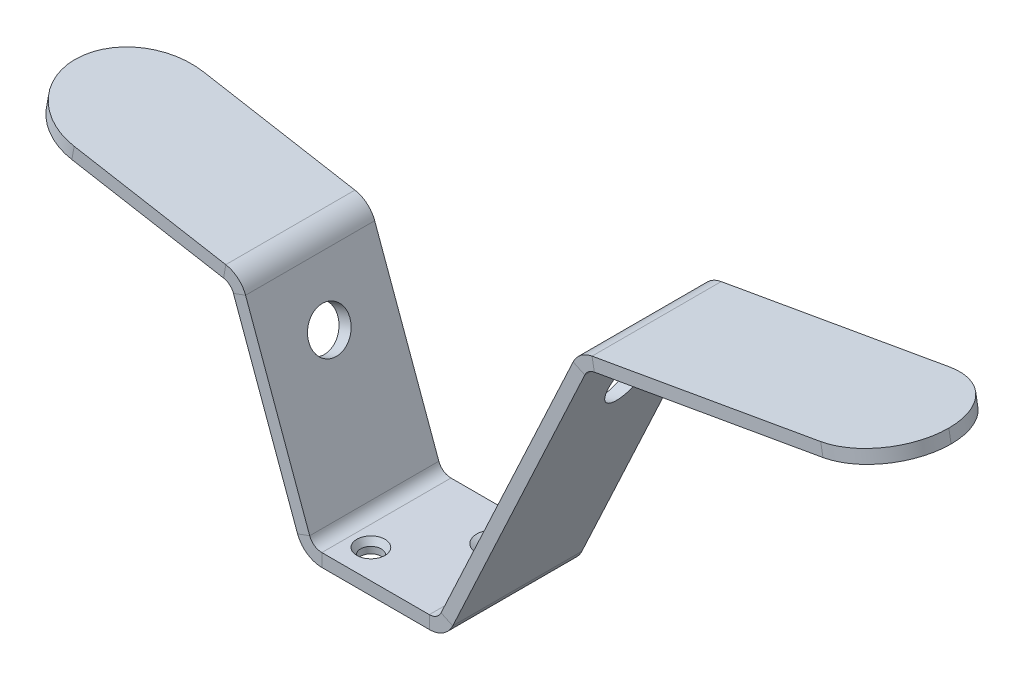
ISO-10303-21;
HEADER;
FILE_DESCRIPTION(('STEP AP214'),'2;1');
FILE_NAME('part.step','',(''),(''),'','','');
FILE_SCHEMA(('AUTOMOTIVE_DESIGN { 1 0 10303 214 1 1 1 1 }'));
ENDSEC;
DATA;
#1=APPLICATION_CONTEXT('core data for automotive mechanical design processes');
#2=APPLICATION_PROTOCOL_DEFINITION('international standard','automotive_design',2000,#1);
#3=PRODUCT_CONTEXT('',#1,'mechanical');
#4=PRODUCT('Part','Part','',(#3));
#5=PRODUCT_RELATED_PRODUCT_CATEGORY('part','',(#4));
#6=PRODUCT_DEFINITION_FORMATION('','',#4);
#7=PRODUCT_DEFINITION_CONTEXT('part definition',#1,'design');
#8=PRODUCT_DEFINITION('design','',#6,#7);
#9=PRODUCT_DEFINITION_SHAPE('','',#8);
#10=(LENGTH_UNIT() NAMED_UNIT(*) SI_UNIT(.MILLI.,.METRE.));
#11=(NAMED_UNIT(*) PLANE_ANGLE_UNIT() SI_UNIT($,.RADIAN.));
#12=(NAMED_UNIT(*) SI_UNIT($,.STERADIAN.) SOLID_ANGLE_UNIT());
#13=UNCERTAINTY_MEASURE_WITH_UNIT(LENGTH_MEASURE(1.E-05),#10,'distance_accuracy_value','');
#14=(GEOMETRIC_REPRESENTATION_CONTEXT(3) GLOBAL_UNCERTAINTY_ASSIGNED_CONTEXT((#13)) GLOBAL_UNIT_ASSIGNED_CONTEXT((#10,
#11,#12)) REPRESENTATION_CONTEXT('',''));
#15=CARTESIAN_POINT('',(0.,0.,0.));
#16=DIRECTION('',(0.,0.,1.));
#17=DIRECTION('',(1.,0.,0.));
#18=AXIS2_PLACEMENT_3D('',#15,#16,#17);
#19=CARTESIAN_POINT('',(-71.2127899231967,-40.1106257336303,10.));
#20=DIRECTION('',(0.173648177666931,0.984807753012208,0.));
#21=DIRECTION('',(-0.984807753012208,0.173648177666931,0.));
#22=AXIS2_PLACEMENT_3D('',#19,#20,#21);
#23=CYLINDRICAL_SURFACE('',#22,10.);
#24=DIRECTION('',(0.173648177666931,0.984807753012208,0.));
#25=VECTOR('',#24,1.);
#26=CARTESIAN_POINT('',(-81.0608674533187,-38.374143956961,10.));
#27=LINE('',#26,#25);
#28=CARTESIAN_POINT('',(-67.7549360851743,37.0875427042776,10.));
#29=VERTEX_POINT('',#28);
#30=CARTESIAN_POINT('',(-67.4076397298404,39.057158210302,10.));
#31=VERTEX_POINT('',#30);
#32=EDGE_CURVE('E266',#29,#31,#27,.T.);
#33=ORIENTED_EDGE('',*,*,#32,.T.);
#34=CARTESIAN_POINT('',(-57.5595621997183,37.3206764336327,10.));
#35=DIRECTION('',(-0.173648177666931,-0.984807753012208,0.));
#36=DIRECTION('',(0.984807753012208,-0.173648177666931,0.));
#37=AXIS2_PLACEMENT_3D('',#34,#35,#36);
#38=CIRCLE('',#37,10.);
#39=CARTESIAN_POINT('',(-57.5595621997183,37.3206764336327,0.));
#40=VERTEX_POINT('',#39);
#41=EDGE_CURVE('E436',#40,#31,#38,.F.);
#42=ORIENTED_EDGE('',*,*,#41,.F.);
#43=DIRECTION('',(0.173648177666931,0.984807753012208,0.));
#44=VECTOR('',#43,1.);
#45=CARTESIAN_POINT('',(-71.2127899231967,-40.1106257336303,0.));
#46=LINE('',#45,#44);
#47=CARTESIAN_POINT('',(-57.9068585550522,35.3510609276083,0.));
#48=VERTEX_POINT('',#47);
#49=EDGE_CURVE('E260',#48,#40,#46,.T.);
#50=ORIENTED_EDGE('',*,*,#49,.F.);
#51=CARTESIAN_POINT('',(-57.9068585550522,35.3510609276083,10.));
#52=DIRECTION('',(-0.173648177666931,-0.984807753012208,0.));
#53=DIRECTION('',(0.984807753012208,-0.173648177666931,0.));
#54=AXIS2_PLACEMENT_3D('',#51,#52,#53);
#55=CIRCLE('',#54,10.);
#56=EDGE_CURVE('E44',#29,#48,#55,.T.);
#57=ORIENTED_EDGE('',*,*,#56,.F.);
#58=EDGE_LOOP('',(#33,#42,#50,#57));
#59=FACE_BOUND('',#58,.T.);
#60=ADVANCED_FACE('F27',(#59),#23,.T.);
#61=CARTESIAN_POINT('',(-71.2127899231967,-40.1106257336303,10.));
#62=DIRECTION('',(0.173648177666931,0.984807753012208,0.));
#63=DIRECTION('',(-0.984807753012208,0.173648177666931,0.));
#64=AXIS2_PLACEMENT_3D('',#61,#62,#63);
#65=CYLINDRICAL_SURFACE('',#64,10.);
#66=DIRECTION('',(0.173648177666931,0.984807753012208,0.));
#67=VECTOR('',#66,1.);
#68=CARTESIAN_POINT('',(-71.2127899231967,-40.1106257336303,20.));
#69=LINE('',#68,#67);
#70=CARTESIAN_POINT('',(-57.9068585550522,35.3510609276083,20.));
#71=VERTEX_POINT('',#70);
#72=CARTESIAN_POINT('',(-57.5595621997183,37.3206764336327,20.));
#73=VERTEX_POINT('',#72);
#74=EDGE_CURVE('E268',#71,#73,#69,.T.);
#75=ORIENTED_EDGE('',*,*,#74,.T.);
#76=CARTESIAN_POINT('',(-57.5595621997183,37.3206764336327,10.));
#77=DIRECTION('',(-0.173648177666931,-0.984807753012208,0.));
#78=DIRECTION('',(0.984807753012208,-0.173648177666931,0.));
#79=AXIS2_PLACEMENT_3D('',#76,#77,#78);
#80=CIRCLE('',#79,10.);
#81=EDGE_CURVE('E72',#31,#73,#80,.F.);
#82=ORIENTED_EDGE('',*,*,#81,.F.);
#83=ORIENTED_EDGE('',*,*,#32,.F.);
#84=CARTESIAN_POINT('',(-57.9068585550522,35.3510609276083,10.));
#85=DIRECTION('',(-0.173648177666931,-0.984807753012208,0.));
#86=DIRECTION('',(0.984807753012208,-0.173648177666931,0.));
#87=AXIS2_PLACEMENT_3D('',#84,#85,#86);
#88=CIRCLE('',#87,10.);
#89=EDGE_CURVE('E430',#71,#29,#88,.T.);
#90=ORIENTED_EDGE('',*,*,#89,.F.);
#91=EDGE_LOOP('',(#75,#82,#83,#90));
#92=FACE_BOUND('',#91,.T.);
#93=ADVANCED_FACE('F445',(#92),#65,.T.);
#94=CARTESIAN_POINT('',(-46.5925960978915,-44.4518301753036,20.));
#95=DIRECTION('',(0.,0.,-1.));
#96=DIRECTION('',(-0.984807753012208,0.173648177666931,0.));
#97=AXIS2_PLACEMENT_3D('',#94,#95,#96);
#98=PLANE('',#97);
#99=DIRECTION('',(0.173648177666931,0.984807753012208,0.));
#100=VECTOR('',#99,1.);
#101=CARTESIAN_POINT('',(-47.7297541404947,-44.251318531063,20.));
#102=LINE('',#101,#100);
#103=CARTESIAN_POINT('',(-34.4238227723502,31.2103681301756,20.));
#104=VERTEX_POINT('',#103);
#105=CARTESIAN_POINT('',(-34.0765264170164,33.1799836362,20.));
#106=VERTEX_POINT('',#105);
#107=EDGE_CURVE('E443',#104,#106,#102,.T.);
#108=ORIENTED_EDGE('',*,*,#107,.T.);
#109=DIRECTION('',(-0.984807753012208,0.173648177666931,0.));
#110=VECTOR('',#109,1.);
#111=CARTESIAN_POINT('',(-32.9393683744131,32.9794719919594,20.));
#112=LINE('',#111,#110);
#113=EDGE_CURVE('E65',#106,#73,#112,.T.);
#114=ORIENTED_EDGE('',*,*,#113,.T.);
#115=ORIENTED_EDGE('',*,*,#74,.F.);
#116=DIRECTION('',(-0.984807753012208,0.173648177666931,0.));
#117=VECTOR('',#116,1.);
#118=CARTESIAN_POINT('',(-33.286664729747,31.009856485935,20.));
#119=LINE('',#118,#117);
#120=EDGE_CURVE('E432',#104,#71,#119,.T.);
#121=ORIENTED_EDGE('',*,*,#120,.F.);
#122=EDGE_LOOP('',(#108,#114,#115,#121));
#123=FACE_BOUND('',#122,.T.);
#124=ADVANCED_FACE('F455',(#123),#98,.F.);
#125=CARTESIAN_POINT('',(-32.9393683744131,32.9794719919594,20.));
#126=DIRECTION('',(-0.173648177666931,-0.984807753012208,0.));
#127=DIRECTION('',(0.984807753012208,-0.173648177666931,0.));
#128=AXIS2_PLACEMENT_3D('',#125,#126,#127);
#129=PLANE('',#128);
#130=ORIENTED_EDGE('',*,*,#113,.F.);
#131=DIRECTION('',(0.,0.,-1.));
#132=VECTOR('',#131,1.);
#133=CARTESIAN_POINT('',(-34.0765264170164,33.1799836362,20.));
#134=LINE('',#133,#132);
#135=CARTESIAN_POINT('',(-34.0765264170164,33.1799836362,0.));
#136=VERTEX_POINT('',#135);
#137=EDGE_CURVE('E440',#106,#136,#134,.T.);
#138=ORIENTED_EDGE('',*,*,#137,.T.);
#139=DIRECTION('',(-0.984807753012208,0.173648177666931,0.));
#140=VECTOR('',#139,1.);
#141=CARTESIAN_POINT('',(-32.9393683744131,32.9794719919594,0.));
#142=LINE('',#141,#140);
#143=EDGE_CURVE('E265',#136,#40,#142,.T.);
#144=ORIENTED_EDGE('',*,*,#143,.T.);
#145=ORIENTED_EDGE('',*,*,#41,.T.);
#146=ORIENTED_EDGE('',*,*,#81,.T.);
#147=EDGE_LOOP('',(#130,#138,#144,#145,#146));
#148=FACE_BOUND('',#147,.T.);
#149=ADVANCED_FACE('F447',(#148),#129,.F.);
#150=CARTESIAN_POINT('',(-46.5925960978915,-44.4518301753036,0.));
#151=DIRECTION('',(0.,0.,-1.));
#152=DIRECTION('',(-0.984807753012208,0.173648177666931,0.));
#153=AXIS2_PLACEMENT_3D('',#150,#151,#152);
#154=PLANE('',#153);
#155=ORIENTED_EDGE('',*,*,#143,.F.);
#156=DIRECTION('',(0.173648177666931,0.984807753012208,0.));
#157=VECTOR('',#156,1.);
#158=CARTESIAN_POINT('',(-47.7297541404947,-44.251318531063,0.));
#159=LINE('',#158,#157);
#160=CARTESIAN_POINT('',(-34.4238227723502,31.2103681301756,0.));
#161=VERTEX_POINT('',#160);
#162=EDGE_CURVE('E245',#161,#136,#159,.T.);
#163=ORIENTED_EDGE('',*,*,#162,.F.);
#164=DIRECTION('',(-0.984807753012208,0.173648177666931,0.));
#165=VECTOR('',#164,1.);
#166=CARTESIAN_POINT('',(-33.286664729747,31.009856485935,0.));
#167=LINE('',#166,#165);
#168=EDGE_CURVE('E257',#161,#48,#167,.T.);
#169=ORIENTED_EDGE('',*,*,#168,.T.);
#170=ORIENTED_EDGE('',*,*,#49,.T.);
#171=EDGE_LOOP('',(#155,#163,#169,#170));
#172=FACE_BOUND('',#171,.T.);
#173=ADVANCED_FACE('F263',(#172),#154,.T.);
#174=CARTESIAN_POINT('',(-33.286664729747,31.009856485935,20.));
#175=DIRECTION('',(-0.173648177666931,-0.984807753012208,0.));
#176=DIRECTION('',(0.984807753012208,-0.173648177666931,0.));
#177=AXIS2_PLACEMENT_3D('',#174,#175,#176);
#178=PLANE('',#177);
#179=DIRECTION('',(0.,0.,-1.));
#180=VECTOR('',#179,1.);
#181=CARTESIAN_POINT('',(-34.4238227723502,31.2103681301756,20.));
#182=LINE('',#181,#180);
#183=EDGE_CURVE('E253',#104,#161,#182,.T.);
#184=ORIENTED_EDGE('',*,*,#183,.F.);
#185=ORIENTED_EDGE('',*,*,#120,.T.);
#186=ORIENTED_EDGE('',*,*,#89,.T.);
#187=ORIENTED_EDGE('',*,*,#56,.T.);
#188=ORIENTED_EDGE('',*,*,#168,.F.);
#189=EDGE_LOOP('',(#184,#185,#186,#187,#188));
#190=FACE_BOUND('',#189,.T.);
#191=ADVANCED_FACE('F29',(#190),#178,.T.);
#192=CARTESIAN_POINT('',(-84.4215460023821,1.92113291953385,10.));
#193=DIRECTION('',(0.93969262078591,0.342020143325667,0.));
#194=DIRECTION('',(-0.342020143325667,0.93969262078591,0.));
#195=AXIS2_PLACEMENT_3D('',#192,#193,#194);
#196=CYLINDRICAL_SURFACE('',#195,3.2);
#197=CARTESIAN_POINT('',(-29.9193739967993,21.7583012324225,10.));
#198=DIRECTION('',(-0.93969262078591,-0.342020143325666,0.));
#199=DIRECTION('',(0.342020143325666,-0.93969262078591,0.));
#200=AXIS2_PLACEMENT_3D('',#197,#198,#199);
#201=CIRCLE('',#200,3.2);
#202=CARTESIAN_POINT('',(-28.8249095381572,18.7512848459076,10.));
#203=VERTEX_POINT('',#202);
#204=EDGE_CURVE('E421',#203,#203,#201,.T.);
#205=ORIENTED_EDGE('',*,*,#204,.T.);
#206=EDGE_LOOP('',(#205));
#207=FACE_BOUND('',#206,.T.);
#208=CARTESIAN_POINT('',(-28.0399887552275,22.4423415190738,10.));
#209=DIRECTION('',(-0.93969262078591,-0.342020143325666,0.));
#210=DIRECTION('',(0.342020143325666,-0.93969262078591,0.));
#211=AXIS2_PLACEMENT_3D('',#208,#209,#210);
#212=CIRCLE('',#211,3.2);
#213=CARTESIAN_POINT('',(-26.9455242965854,19.4353251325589,10.));
#214=VERTEX_POINT('',#213);
#215=EDGE_CURVE('E401',#214,#214,#212,.T.);
#216=ORIENTED_EDGE('',*,*,#215,.F.);
#217=EDGE_LOOP('',(#216));
#218=FACE_BOUND('',#217,.T.);
#219=ADVANCED_FACE('F468',(#207,#218),#196,.F.);
#220=CARTESIAN_POINT('',(46.1548658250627,24.8063424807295,0.));
#221=DIRECTION('',(0.,0.,1.));
#222=DIRECTION('',(0.342020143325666,-0.93969262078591,0.));
#223=AXIS2_PLACEMENT_3D('',#220,#221,#222);
#224=PLANE('',#223);
#225=DIRECTION('',(0.342020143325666,-0.93969262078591,0.));
#226=VECTOR('',#225,1.);
#227=CARTESIAN_POINT('',(-22.,0.,0.));
#228=LINE('',#227,#226);
#229=CARTESIAN_POINT('',(-32.8917338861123,29.9247929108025,0.));
#230=VERTEX_POINT('',#229);
#231=CARTESIAN_POINT('',(-22.9579403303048,2.63191942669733,0.));
#232=VERTEX_POINT('',#231);
#233=EDGE_CURVE('E411',#230,#232,#228,.T.);
#234=ORIENTED_EDGE('',*,*,#233,.F.);
#235=DIRECTION('',(-0.93969262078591,-0.342020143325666,0.));
#236=VECTOR('',#235,1.);
#237=CARTESIAN_POINT('',(35.2631319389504,54.731135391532,0.));
#238=LINE('',#237,#236);
#239=CARTESIAN_POINT('',(-31.0123486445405,30.6088331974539,0.));
#240=VERTEX_POINT('',#239);
#241=EDGE_CURVE('E248',#240,#230,#238,.T.);
#242=ORIENTED_EDGE('',*,*,#241,.F.);
#243=DIRECTION('',(0.342020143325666,-0.93969262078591,0.));
#244=VECTOR('',#243,1.);
#245=CARTESIAN_POINT('',(-20.1206147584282,0.684040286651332,0.));
#246=LINE('',#245,#244);
#247=CARTESIAN_POINT('',(-21.078555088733,3.31595971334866,0.));
#248=VERTEX_POINT('',#247);
#249=EDGE_CURVE('E416',#240,#248,#246,.T.);
#250=ORIENTED_EDGE('',*,*,#249,.T.);
#251=DIRECTION('',(-0.93969262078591,-0.342020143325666,0.));
#252=VECTOR('',#251,1.);
#253=CARTESIAN_POINT('',(45.1969254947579,27.4382619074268,0.));
#254=LINE('',#253,#252);
#255=EDGE_CURVE('E413',#248,#232,#254,.T.);
#256=ORIENTED_EDGE('',*,*,#255,.T.);
#257=EDGE_LOOP('',(#234,#242,#250,#256));
#258=FACE_BOUND('',#257,.T.);
#259=ADVANCED_FACE('F472',(#258),#224,.F.);
#260=CARTESIAN_POINT('',(-22.,0.,20.));
#261=DIRECTION('',(-0.93969262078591,-0.342020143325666,0.));
#262=DIRECTION('',(0.342020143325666,-0.93969262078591,0.));
#263=AXIS2_PLACEMENT_3D('',#260,#261,#262);
#264=PLANE('',#263);
#265=DIRECTION('',(0.,0.,1.));
#266=VECTOR('',#265,1.);
#267=CARTESIAN_POINT('',(-32.8917338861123,29.9247929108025,20.));
#268=LINE('',#267,#266);
#269=CARTESIAN_POINT('',(-32.8917338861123,29.9247929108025,20.));
#270=VERTEX_POINT('',#269);
#271=EDGE_CURVE('E419',#230,#270,#268,.T.);
#272=ORIENTED_EDGE('',*,*,#271,.F.);
#273=ORIENTED_EDGE('',*,*,#233,.T.);
#274=DIRECTION('',(0.,0.,-1.));
#275=VECTOR('',#274,1.);
#276=CARTESIAN_POINT('',(-22.9579403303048,2.63191942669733,0.));
#277=LINE('',#276,#275);
#278=CARTESIAN_POINT('',(-22.9579403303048,2.63191942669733,20.));
#279=VERTEX_POINT('',#278);
#280=EDGE_CURVE('E424',#279,#232,#277,.T.);
#281=ORIENTED_EDGE('',*,*,#280,.F.);
#282=DIRECTION('',(-0.342020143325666,0.93969262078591,0.));
#283=VECTOR('',#282,1.);
#284=CARTESIAN_POINT('',(-22.,0.,20.));
#285=LINE('',#284,#283);
#286=EDGE_CURVE('E408',#279,#270,#285,.T.);
#287=ORIENTED_EDGE('',*,*,#286,.T.);
#288=EDGE_LOOP('',(#272,#273,#281,#287));
#289=FACE_BOUND('',#288,.T.);
#290=ORIENTED_EDGE('',*,*,#204,.F.);
#291=EDGE_LOOP('',(#290));
#292=FACE_BOUND('',#291,.T.);
#293=ADVANCED_FACE('F478',(#289,#292),#264,.T.);
#294=CARTESIAN_POINT('',(46.1548658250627,24.8063424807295,20.));
#295=DIRECTION('',(0.,0.,1.));
#296=DIRECTION('',(0.342020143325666,-0.93969262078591,0.));
#297=AXIS2_PLACEMENT_3D('',#294,#295,#296);
#298=PLANE('',#297);
#299=DIRECTION('',(-0.93969262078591,-0.342020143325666,0.));
#300=VECTOR('',#299,1.);
#301=CARTESIAN_POINT('',(35.2631319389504,54.731135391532,20.));
#302=LINE('',#301,#300);
#303=CARTESIAN_POINT('',(-31.0123486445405,30.6088331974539,20.));
#304=VERTEX_POINT('',#303);
#305=EDGE_CURVE('E405',#304,#270,#302,.T.);
#306=ORIENTED_EDGE('',*,*,#305,.T.);
#307=ORIENTED_EDGE('',*,*,#286,.F.);
#308=DIRECTION('',(-0.93969262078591,-0.342020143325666,0.));
#309=VECTOR('',#308,1.);
#310=CARTESIAN_POINT('',(45.1969254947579,27.4382619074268,20.));
#311=LINE('',#310,#309);
#312=CARTESIAN_POINT('',(-21.078555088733,3.31595971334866,20.));
#313=VERTEX_POINT('',#312);
#314=EDGE_CURVE('E365',#313,#279,#311,.T.);
#315=ORIENTED_EDGE('',*,*,#314,.F.);
#316=DIRECTION('',(-0.342020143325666,0.93969262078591,0.));
#317=VECTOR('',#316,1.);
#318=CARTESIAN_POINT('',(-20.1206147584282,0.684040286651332,20.));
#319=LINE('',#318,#317);
#320=EDGE_CURVE('E94',#313,#304,#319,.T.);
#321=ORIENTED_EDGE('',*,*,#320,.T.);
#322=EDGE_LOOP('',(#306,#307,#315,#321));
#323=FACE_BOUND('',#322,.T.);
#324=ADVANCED_FACE('F487',(#323),#298,.T.);
#325=CARTESIAN_POINT('',(-20.1206147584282,0.684040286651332,20.));
#326=DIRECTION('',(-0.93969262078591,-0.342020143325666,0.));
#327=DIRECTION('',(0.342020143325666,-0.93969262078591,0.));
#328=AXIS2_PLACEMENT_3D('',#325,#326,#327);
#329=PLANE('',#328);
#330=ORIENTED_EDGE('',*,*,#215,.T.);
#331=EDGE_LOOP('',(#330));
#332=FACE_BOUND('',#331,.T.);
#333=ORIENTED_EDGE('',*,*,#249,.F.);
#334=DIRECTION('',(0.,0.,1.));
#335=VECTOR('',#334,1.);
#336=CARTESIAN_POINT('',(-31.0123486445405,30.6088331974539,20.));
#337=LINE('',#336,#335);
#338=EDGE_CURVE('E399',#240,#304,#337,.T.);
#339=ORIENTED_EDGE('',*,*,#338,.T.);
#340=ORIENTED_EDGE('',*,*,#320,.F.);
#341=DIRECTION('',(0.,0.,-1.));
#342=VECTOR('',#341,1.);
#343=CARTESIAN_POINT('',(-21.078555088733,3.31595971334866,0.));
#344=LINE('',#343,#342);
#345=EDGE_CURVE('E99',#313,#248,#344,.T.);
#346=ORIENTED_EDGE('',*,*,#345,.T.);
#347=EDGE_LOOP('',(#333,#339,#340,#346));
#348=FACE_BOUND('',#347,.T.);
#349=ADVANCED_FACE('F458',(#332,#348),#329,.F.);
#350=CARTESIAN_POINT('',(75.4739365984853,-43.1985139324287,10.));
#351=DIRECTION('',(-0.173648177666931,0.984807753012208,0.));
#352=DIRECTION('',(-0.984807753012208,-0.173648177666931,0.));
#353=AXIS2_PLACEMENT_3D('',#350,#351,#352);
#354=CYLINDRICAL_SURFACE('',#353,10.);
#355=DIRECTION('',(-0.173648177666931,0.984807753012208,0.));
#356=VECTOR('',#355,1.);
#357=CARTESIAN_POINT('',(85.3220141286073,-41.4620321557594,10.));
#358=LINE('',#357,#356);
#359=CARTESIAN_POINT('',(68.2621140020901,55.2894692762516,10.));
#360=VERTEX_POINT('',#359);
#361=CARTESIAN_POINT('',(67.9148176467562,57.259084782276,10.));
#362=VERTEX_POINT('',#361);
#363=EDGE_CURVE('E391',#360,#362,#358,.T.);
#364=ORIENTED_EDGE('',*,*,#363,.T.);
#365=CARTESIAN_POINT('',(58.0667401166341,55.5226030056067,10.));
#366=DIRECTION('',(0.173648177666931,-0.984807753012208,0.));
#367=DIRECTION('',(0.984807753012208,0.173648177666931,0.));
#368=AXIS2_PLACEMENT_3D('',#365,#366,#367);
#369=CIRCLE('',#368,10.);
#370=CARTESIAN_POINT('',(58.0667401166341,55.5226030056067,20.));
#371=VERTEX_POINT('',#370);
#372=EDGE_CURVE('E375',#371,#362,#369,.F.);
#373=ORIENTED_EDGE('',*,*,#372,.F.);
#374=DIRECTION('',(-0.173648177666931,0.984807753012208,0.));
#375=VECTOR('',#374,1.);
#376=CARTESIAN_POINT('',(75.4739365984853,-43.1985139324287,20.));
#377=LINE('',#376,#375);
#378=CARTESIAN_POINT('',(58.414036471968,53.5529874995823,20.));
#379=VERTEX_POINT('',#378);
#380=EDGE_CURVE('E371',#379,#371,#377,.T.);
#381=ORIENTED_EDGE('',*,*,#380,.F.);
#382=CARTESIAN_POINT('',(58.414036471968,53.5529874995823,10.));
#383=DIRECTION('',(0.173648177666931,-0.984807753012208,0.));
#384=DIRECTION('',(0.984807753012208,0.173648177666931,0.));
#385=AXIS2_PLACEMENT_3D('',#382,#383,#384);
#386=CIRCLE('',#385,10.);
#387=EDGE_CURVE('E137',#360,#379,#386,.T.);
#388=ORIENTED_EDGE('',*,*,#387,.F.);
#389=EDGE_LOOP('',(#364,#373,#381,#388));
#390=FACE_BOUND('',#389,.T.);
#391=ADVANCED_FACE('F494',(#390),#354,.T.);
#392=CARTESIAN_POINT('',(75.4739365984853,-43.1985139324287,10.));
#393=DIRECTION('',(-0.173648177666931,0.984807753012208,0.));
#394=DIRECTION('',(-0.984807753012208,-0.173648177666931,0.));
#395=AXIS2_PLACEMENT_3D('',#392,#393,#394);
#396=CYLINDRICAL_SURFACE('',#395,10.);
#397=DIRECTION('',(-0.173648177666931,0.984807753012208,0.));
#398=VECTOR('',#397,1.);
#399=CARTESIAN_POINT('',(75.4739365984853,-43.1985139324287,0.));
#400=LINE('',#399,#398);
#401=CARTESIAN_POINT('',(58.414036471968,53.5529874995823,0.));
#402=VERTEX_POINT('',#401);
#403=CARTESIAN_POINT('',(58.0667401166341,55.5226030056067,0.));
#404=VERTEX_POINT('',#403);
#405=EDGE_CURVE('E389',#402,#404,#400,.T.);
#406=ORIENTED_EDGE('',*,*,#405,.T.);
#407=CARTESIAN_POINT('',(58.0667401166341,55.5226030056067,10.));
#408=DIRECTION('',(0.173648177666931,-0.984807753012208,0.));
#409=DIRECTION('',(0.984807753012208,0.173648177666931,0.));
#410=AXIS2_PLACEMENT_3D('',#407,#408,#409);
#411=CIRCLE('',#410,10.);
#412=EDGE_CURVE('E373',#362,#404,#411,.F.);
#413=ORIENTED_EDGE('',*,*,#412,.F.);
#414=ORIENTED_EDGE('',*,*,#363,.F.);
#415=CARTESIAN_POINT('',(58.414036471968,53.5529874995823,10.));
#416=DIRECTION('',(0.173648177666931,-0.984807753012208,0.));
#417=DIRECTION('',(0.984807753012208,0.173648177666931,0.));
#418=AXIS2_PLACEMENT_3D('',#415,#416,#417);
#419=CIRCLE('',#418,10.);
#420=EDGE_CURVE('E130',#402,#360,#419,.T.);
#421=ORIENTED_EDGE('',*,*,#420,.F.);
#422=EDGE_LOOP('',(#406,#413,#414,#421));
#423=FACE_BOUND('',#422,.T.);
#424=ADVANCED_FACE('F626',(#423),#396,.T.);
#425=CARTESIAN_POINT('',(85.3220141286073,-41.4620321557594,0.));
#426=DIRECTION('',(0.,0.,-1.));
#427=DIRECTION('',(-0.984807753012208,-0.173648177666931,0.));
#428=AXIS2_PLACEMENT_3D('',#425,#426,#427);
#429=PLANE('',#428);
#430=DIRECTION('',(-0.984807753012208,-0.173648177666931,0.));
#431=VECTOR('',#430,1.);
#432=CARTESIAN_POINT('',(67.9148176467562,57.259084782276,0.));
#433=LINE('',#432,#431);
#434=CARTESIAN_POINT('',(22.6541701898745,49.2784114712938,0.));
#435=VERTEX_POINT('',#434);
#436=EDGE_CURVE('E380',#404,#435,#433,.T.);
#437=ORIENTED_EDGE('',*,*,#436,.F.);
#438=ORIENTED_EDGE('',*,*,#405,.F.);
#439=DIRECTION('',(-0.984807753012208,-0.173648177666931,0.));
#440=VECTOR('',#439,1.);
#441=CARTESIAN_POINT('',(68.26211400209,55.2894692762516,0.));
#442=LINE('',#441,#440);
#443=CARTESIAN_POINT('',(23.0014665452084,47.3087959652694,0.));
#444=VERTEX_POINT('',#443);
#445=EDGE_CURVE('E386',#402,#444,#442,.T.);
#446=ORIENTED_EDGE('',*,*,#445,.T.);
#447=DIRECTION('',(-0.173648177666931,0.984807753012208,0.));
#448=VECTOR('',#447,1.);
#449=CARTESIAN_POINT('',(40.0613666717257,-49.4427054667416,0.));
#450=LINE('',#449,#448);
#451=EDGE_CURVE('E383',#444,#435,#450,.T.);
#452=ORIENTED_EDGE('',*,*,#451,.T.);
#453=EDGE_LOOP('',(#437,#438,#446,#452));
#454=FACE_BOUND('',#453,.T.);
#455=ADVANCED_FACE('F629',(#454),#429,.T.);
#456=CARTESIAN_POINT('',(67.9148176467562,57.259084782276,20.));
#457=DIRECTION('',(0.173648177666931,-0.984807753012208,0.));
#458=DIRECTION('',(0.984807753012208,0.173648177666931,0.));
#459=AXIS2_PLACEMENT_3D('',#456,#457,#458);
#460=PLANE('',#459);
#461=ORIENTED_EDGE('',*,*,#436,.T.);
#462=DIRECTION('',(0.,0.,1.));
#463=VECTOR('',#462,1.);
#464=CARTESIAN_POINT('',(22.6541701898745,49.2784114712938,0.));
#465=LINE('',#464,#463);
#466=CARTESIAN_POINT('',(22.6541701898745,49.2784114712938,20.));
#467=VERTEX_POINT('',#466);
#468=EDGE_CURVE('E377',#435,#467,#465,.T.);
#469=ORIENTED_EDGE('',*,*,#468,.T.);
#470=DIRECTION('',(-0.984807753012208,-0.173648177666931,0.));
#471=VECTOR('',#470,1.);
#472=CARTESIAN_POINT('',(67.9148176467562,57.259084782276,20.));
#473=LINE('',#472,#471);
#474=EDGE_CURVE('E368',#371,#467,#473,.T.);
#475=ORIENTED_EDGE('',*,*,#474,.F.);
#476=ORIENTED_EDGE('',*,*,#372,.T.);
#477=ORIENTED_EDGE('',*,*,#412,.T.);
#478=EDGE_LOOP('',(#461,#469,#475,#476,#477));
#479=FACE_BOUND('',#478,.T.);
#480=ADVANCED_FACE('F632',(#479),#460,.F.);
#481=CARTESIAN_POINT('',(85.3220141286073,-41.4620321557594,20.));
#482=DIRECTION('',(0.,0.,-1.));
#483=DIRECTION('',(-0.984807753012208,-0.173648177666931,0.));
#484=AXIS2_PLACEMENT_3D('',#481,#482,#483);
#485=PLANE('',#484);
#486=ORIENTED_EDGE('',*,*,#380,.T.);
#487=ORIENTED_EDGE('',*,*,#474,.T.);
#488=DIRECTION('',(-0.173648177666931,0.984807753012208,0.));
#489=VECTOR('',#488,1.);
#490=CARTESIAN_POINT('',(40.0613666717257,-49.4427054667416,20.));
#491=LINE('',#490,#489);
#492=CARTESIAN_POINT('',(23.0014665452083,47.3087959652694,20.));
#493=VERTEX_POINT('',#492);
#494=EDGE_CURVE('E393',#493,#467,#491,.T.);
#495=ORIENTED_EDGE('',*,*,#494,.F.);
#496=DIRECTION('',(-0.984807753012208,-0.173648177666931,0.));
#497=VECTOR('',#496,1.);
#498=CARTESIAN_POINT('',(68.26211400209,55.2894692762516,20.));
#499=LINE('',#498,#497);
#500=EDGE_CURVE('E108',#379,#493,#499,.T.);
#501=ORIENTED_EDGE('',*,*,#500,.F.);
#502=EDGE_LOOP('',(#486,#487,#495,#501));
#503=FACE_BOUND('',#502,.T.);
#504=ADVANCED_FACE('F635',(#503),#485,.F.);
#505=CARTESIAN_POINT('',(68.26211400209,55.2894692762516,20.));
#506=DIRECTION('',(0.173648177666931,-0.984807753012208,0.));
#507=DIRECTION('',(0.984807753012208,0.173648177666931,0.));
#508=AXIS2_PLACEMENT_3D('',#505,#506,#507);
#509=PLANE('',#508);
#510=DIRECTION('',(0.,0.,1.));
#511=VECTOR('',#510,1.);
#512=CARTESIAN_POINT('',(23.0014665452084,47.3087959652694,0.));
#513=LINE('',#512,#511);
#514=EDGE_CURVE('E333',#444,#493,#513,.T.);
#515=ORIENTED_EDGE('',*,*,#514,.F.);
#516=ORIENTED_EDGE('',*,*,#445,.F.);
#517=ORIENTED_EDGE('',*,*,#420,.T.);
#518=ORIENTED_EDGE('',*,*,#387,.T.);
#519=ORIENTED_EDGE('',*,*,#500,.T.);
#520=EDGE_LOOP('',(#515,#516,#517,#518,#519));
#521=FACE_BOUND('',#520,.T.);
#522=ADVANCED_FACE('F483',(#521),#509,.T.);
#523=CARTESIAN_POINT('',(-84.4215460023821,1.92113291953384,10.));
#524=DIRECTION('',(0.939692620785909,0.342020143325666,0.));
#525=DIRECTION('',(-0.342020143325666,0.93969262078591,0.));
#526=AXIS2_PLACEMENT_3D('',#523,#524,#525);
#527=CYLINDRICAL_SURFACE('',#526,3.2);
#528=CARTESIAN_POINT('',(18.3360798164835,39.3218500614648,10.));
#529=DIRECTION('',(0.906307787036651,-0.422618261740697,0.));
#530=DIRECTION('',(0.422618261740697,0.906307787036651,0.));
#531=AXIS2_PLACEMENT_3D('',#528,#529,#530);
#532=ELLIPSE('',#531,4.52548339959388,3.2);
#533=CARTESIAN_POINT('',(20.2486317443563,43.4233309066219,10.));
#534=VERTEX_POINT('',#533);
#535=EDGE_CURVE('E357',#534,#534,#532,.T.);
#536=ORIENTED_EDGE('',*,*,#535,.T.);
#537=EDGE_LOOP('',(#536));
#538=FACE_BOUND('',#537,.T.);
#539=CARTESIAN_POINT('',(15.6782277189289,38.354471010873,10.));
#540=DIRECTION('',(0.906307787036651,-0.422618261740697,0.));
#541=DIRECTION('',(0.422618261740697,0.906307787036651,0.));
#542=AXIS2_PLACEMENT_3D('',#539,#540,#541);
#543=ELLIPSE('',#542,4.52548339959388,3.2);
#544=CARTESIAN_POINT('',(17.5907796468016,42.45595185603,10.));
#545=VERTEX_POINT('',#544);
#546=EDGE_CURVE('E340',#545,#545,#543,.T.);
#547=ORIENTED_EDGE('',*,*,#546,.F.);
#548=EDGE_LOOP('',(#547));
#549=FACE_BOUND('',#548,.T.);
#550=ADVANCED_FACE('F610',(#538,#549),#527,.F.);
#551=CARTESIAN_POINT('',(-74.7798911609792,92.2460877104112,20.));
#552=DIRECTION('',(0.,0.,1.));
#553=DIRECTION('',(0.422618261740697,0.906307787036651,0.));
#554=AXIS2_PLACEMENT_3D('',#551,#552,#553);
#555=PLANE('',#554);
#556=DIRECTION('',(0.906307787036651,-0.422618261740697,0.));
#557=VECTOR('',#556,1.);
#558=CARTESIAN_POINT('',(-95.6790906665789,47.4276097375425,20.));
#559=LINE('',#558,#557);
#560=CARTESIAN_POINT('',(-0.735665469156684,3.1547634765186,20.));
#561=VERTEX_POINT('',#560);
#562=CARTESIAN_POINT('',(1.07695010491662,2.30952695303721,20.));
#563=VERTEX_POINT('',#562);
#564=EDGE_CURVE('E351',#561,#563,#559,.T.);
#565=ORIENTED_EDGE('',*,*,#564,.T.);
#566=DIRECTION('',(0.422618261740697,0.906307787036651,0.));
#567=VECTOR('',#566,1.);
#568=CARTESIAN_POINT('',(21.9761496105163,47.1280049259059,20.));
#569=LINE('',#568,#567);
#570=CARTESIAN_POINT('',(21.5361473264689,46.1844169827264,20.));
#571=VERTEX_POINT('',#570);
#572=EDGE_CURVE('E348',#563,#571,#569,.T.);
#573=ORIENTED_EDGE('',*,*,#572,.T.);
#574=DIRECTION('',(0.906307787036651,-0.422618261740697,0.));
#575=VECTOR('',#574,1.);
#576=CARTESIAN_POINT('',(-75.2198934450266,91.3024997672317,20.));
#577=LINE('',#576,#575);
#578=CARTESIAN_POINT('',(19.7235317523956,47.0296535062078,20.));
#579=VERTEX_POINT('',#578);
#580=EDGE_CURVE('E353',#579,#571,#577,.T.);
#581=ORIENTED_EDGE('',*,*,#580,.F.);
#582=DIRECTION('',(0.422618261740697,0.906307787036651,0.));
#583=VECTOR('',#582,1.);
#584=CARTESIAN_POINT('',(20.163534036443,47.9732414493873,20.));
#585=LINE('',#584,#583);
#586=EDGE_CURVE('E165',#561,#579,#585,.T.);
#587=ORIENTED_EDGE('',*,*,#586,.F.);
#588=EDGE_LOOP('',(#565,#573,#581,#587));
#589=FACE_BOUND('',#588,.T.);
#590=ADVANCED_FACE('F577',(#589),#555,.T.);
#591=CARTESIAN_POINT('',(21.9761496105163,47.1280049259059,20.));
#592=DIRECTION('',(0.906307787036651,-0.422618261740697,0.));
#593=DIRECTION('',(0.422618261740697,0.906307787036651,0.));
#594=AXIS2_PLACEMENT_3D('',#591,#592,#593);
#595=PLANE('',#594);
#596=DIRECTION('',(0.,0.,-1.));
#597=VECTOR('',#596,1.);
#598=CARTESIAN_POINT('',(21.5361473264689,46.1844169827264,0.));
#599=LINE('',#598,#597);
#600=CARTESIAN_POINT('',(21.5361473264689,46.1844169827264,0.));
#601=VERTEX_POINT('',#600);
#602=EDGE_CURVE('E355',#571,#601,#599,.T.);
#603=ORIENTED_EDGE('',*,*,#602,.F.);
#604=ORIENTED_EDGE('',*,*,#572,.F.);
#605=DIRECTION('',(0.,0.,1.));
#606=VECTOR('',#605,1.);
#607=CARTESIAN_POINT('',(1.07695010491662,2.30952695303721,20.));
#608=LINE('',#607,#606);
#609=CARTESIAN_POINT('',(1.07695010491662,2.30952695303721,0.));
#610=VERTEX_POINT('',#609);
#611=EDGE_CURVE('E360',#610,#563,#608,.T.);
#612=ORIENTED_EDGE('',*,*,#611,.F.);
#613=DIRECTION('',(-0.422618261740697,-0.906307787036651,0.));
#614=VECTOR('',#613,1.);
#615=CARTESIAN_POINT('',(21.9761496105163,47.1280049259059,0.));
#616=LINE('',#615,#614);
#617=EDGE_CURVE('E346',#601,#610,#616,.T.);
#618=ORIENTED_EDGE('',*,*,#617,.F.);
#619=EDGE_LOOP('',(#603,#604,#612,#618));
#620=FACE_BOUND('',#619,.T.);
#621=ORIENTED_EDGE('',*,*,#535,.F.);
#622=EDGE_LOOP('',(#621));
#623=FACE_BOUND('',#622,.T.);
#624=ADVANCED_FACE('F580',(#620,#623),#595,.T.);
#625=CARTESIAN_POINT('',(-74.7798911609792,92.2460877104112,0.));
#626=DIRECTION('',(0.,0.,1.));
#627=DIRECTION('',(0.422618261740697,0.906307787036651,0.));
#628=AXIS2_PLACEMENT_3D('',#625,#626,#627);
#629=PLANE('',#628);
#630=ORIENTED_EDGE('',*,*,#617,.T.);
#631=DIRECTION('',(0.906307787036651,-0.422618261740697,0.));
#632=VECTOR('',#631,1.);
#633=CARTESIAN_POINT('',(-95.6790906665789,47.4276097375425,0.));
#634=LINE('',#633,#632);
#635=CARTESIAN_POINT('',(-0.735665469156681,3.1547634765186,0.));
#636=VERTEX_POINT('',#635);
#637=EDGE_CURVE('E158',#636,#610,#634,.T.);
#638=ORIENTED_EDGE('',*,*,#637,.F.);
#639=DIRECTION('',(-0.422618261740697,-0.906307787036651,0.));
#640=VECTOR('',#639,1.);
#641=CARTESIAN_POINT('',(20.163534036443,47.9732414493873,0.));
#642=LINE('',#641,#640);
#643=CARTESIAN_POINT('',(19.7235317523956,47.0296535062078,0.));
#644=VERTEX_POINT('',#643);
#645=EDGE_CURVE('E334',#644,#636,#642,.T.);
#646=ORIENTED_EDGE('',*,*,#645,.F.);
#647=DIRECTION('',(0.906307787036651,-0.422618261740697,0.));
#648=VECTOR('',#647,1.);
#649=CARTESIAN_POINT('',(-75.2198934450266,91.3024997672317,0.));
#650=LINE('',#649,#648);
#651=EDGE_CURVE('E343',#644,#601,#650,.T.);
#652=ORIENTED_EDGE('',*,*,#651,.T.);
#653=EDGE_LOOP('',(#630,#638,#646,#652));
#654=FACE_BOUND('',#653,.T.);
#655=ADVANCED_FACE('F618',(#654),#629,.F.);
#656=CARTESIAN_POINT('',(20.163534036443,47.9732414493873,20.));
#657=DIRECTION('',(0.906307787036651,-0.422618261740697,0.));
#658=DIRECTION('',(0.422618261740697,0.906307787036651,0.));
#659=AXIS2_PLACEMENT_3D('',#656,#657,#658);
#660=PLANE('',#659);
#661=ORIENTED_EDGE('',*,*,#546,.T.);
#662=EDGE_LOOP('',(#661));
#663=FACE_BOUND('',#662,.T.);
#664=ORIENTED_EDGE('',*,*,#586,.T.);
#665=DIRECTION('',(0.,0.,-1.));
#666=VECTOR('',#665,1.);
#667=CARTESIAN_POINT('',(19.7235317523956,47.0296535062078,0.));
#668=LINE('',#667,#666);
#669=EDGE_CURVE('E336',#579,#644,#668,.T.);
#670=ORIENTED_EDGE('',*,*,#669,.T.);
#671=ORIENTED_EDGE('',*,*,#645,.T.);
#672=DIRECTION('',(0.,0.,1.));
#673=VECTOR('',#672,1.);
#674=CARTESIAN_POINT('',(-0.735665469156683,3.15476347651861,20.));
#675=LINE('',#674,#673);
#676=EDGE_CURVE('E331',#636,#561,#675,.T.);
#677=ORIENTED_EDGE('',*,*,#676,.T.);
#678=EDGE_LOOP('',(#664,#670,#671,#677));
#679=FACE_BOUND('',#678,.T.);
#680=ADVANCED_FACE('F572',(#663,#679),#660,.F.);
#681=CARTESIAN_POINT('',(0.,0.,20.));
#682=DIRECTION('',(0.,-1.,0.));
#683=DIRECTION('',(1.,0.,0.));
#684=AXIS2_PLACEMENT_3D('',#681,#682,#683);
#685=PLANE('',#684);
#686=CARTESIAN_POINT('',(-7.09958492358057,0.,5.5));
#687=DIRECTION('',(0.,1.,0.));
#688=DIRECTION('',(-1.,0.,0.));
#689=AXIS2_PLACEMENT_3D('',#686,#687,#688);
#690=CIRCLE('',#689,1.6);
#691=CARTESIAN_POINT('',(-8.69958492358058,0.,5.5));
#692=VERTEX_POINT('',#691);
#693=EDGE_CURVE('E301',#692,#692,#690,.T.);
#694=ORIENTED_EDGE('',*,*,#693,.T.);
#695=EDGE_LOOP('',(#694));
#696=FACE_BOUND('',#695,.T.);
#697=CARTESIAN_POINT('',(-16.0995849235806,0.,15.5));
#698=DIRECTION('',(0.,1.,0.));
#699=DIRECTION('',(-1.,0.,0.));
#700=AXIS2_PLACEMENT_3D('',#697,#698,#699);
#701=CIRCLE('',#700,1.6);
#702=CARTESIAN_POINT('',(-17.6995849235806,0.,15.5));
#703=VERTEX_POINT('',#702);
#704=EDGE_CURVE('E298',#703,#703,#701,.T.);
#705=ORIENTED_EDGE('',*,*,#704,.T.);
#706=EDGE_LOOP('',(#705));
#707=FACE_BOUND('',#706,.T.);
#708=DIRECTION('',(-1.,0.,0.));
#709=VECTOR('',#708,1.);
#710=CARTESIAN_POINT('',(0.,0.,20.));
#711=LINE('',#710,#709);
#712=CARTESIAN_POINT('',(-2.54828104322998,0.,20.));
#713=VERTEX_POINT('',#712);
#714=CARTESIAN_POINT('',(-19.1991698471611,0.,20.));
#715=VERTEX_POINT('',#714);
#716=EDGE_CURVE('E304',#713,#715,#711,.T.);
#717=ORIENTED_EDGE('',*,*,#716,.T.);
#718=DIRECTION('',(0.,0.,-1.));
#719=VECTOR('',#718,1.);
#720=CARTESIAN_POINT('',(-19.1991698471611,0.,0.));
#721=LINE('',#720,#719);
#722=CARTESIAN_POINT('',(-19.1991698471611,0.,0.));
#723=VERTEX_POINT('',#722);
#724=EDGE_CURVE('E173',#715,#723,#721,.T.);
#725=ORIENTED_EDGE('',*,*,#724,.T.);
#726=DIRECTION('',(-1.,0.,0.));
#727=VECTOR('',#726,1.);
#728=CARTESIAN_POINT('',(0.,0.,0.));
#729=LINE('',#728,#727);
#730=CARTESIAN_POINT('',(-2.54828104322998,0.,0.));
#731=VERTEX_POINT('',#730);
#732=EDGE_CURVE('E300',#731,#723,#729,.T.);
#733=ORIENTED_EDGE('',*,*,#732,.F.);
#734=DIRECTION('',(0.,0.,1.));
#735=VECTOR('',#734,1.);
#736=CARTESIAN_POINT('',(-2.54828104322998,0.,20.));
#737=LINE('',#736,#735);
#738=EDGE_CURVE('E181',#731,#713,#737,.T.);
#739=ORIENTED_EDGE('',*,*,#738,.T.);
#740=EDGE_LOOP('',(#717,#725,#733,#739));
#741=FACE_BOUND('',#740,.T.);
#742=ADVANCED_FACE('F561',(#696,#707,#741),#685,.T.);
#743=CARTESIAN_POINT('',(0.,2.,20.));
#744=DIRECTION('',(0.,-1.,0.));
#745=DIRECTION('',(1.,0.,0.));
#746=AXIS2_PLACEMENT_3D('',#743,#744,#745);
#747=PLANE('',#746);
#748=CARTESIAN_POINT('',(-16.0995849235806,2.,15.5));
#749=DIRECTION('',(0.,-1.,0.));
#750=DIRECTION('',(1.,0.,0.));
#751=AXIS2_PLACEMENT_3D('',#748,#749,#750);
#752=CIRCLE('',#751,2.17735026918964);
#753=CARTESIAN_POINT('',(-13.9222346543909,2.,15.5));
#754=VERTEX_POINT('',#753);
#755=EDGE_CURVE('E36',#754,#754,#752,.T.);
#756=ORIENTED_EDGE('',*,*,#755,.T.);
#757=EDGE_LOOP('',(#756));
#758=FACE_BOUND('',#757,.T.);
#759=CARTESIAN_POINT('',(-7.09958492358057,2.,5.5));
#760=DIRECTION('',(0.,-1.,0.));
#761=DIRECTION('',(1.,0.,0.));
#762=AXIS2_PLACEMENT_3D('',#759,#760,#761);
#763=CIRCLE('',#762,2.59999999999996);
#764=CARTESIAN_POINT('',(-4.49958492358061,2.,5.5));
#765=VERTEX_POINT('',#764);
#766=EDGE_CURVE('E275',#765,#765,#763,.T.);
#767=ORIENTED_EDGE('',*,*,#766,.T.);
#768=EDGE_LOOP('',(#767));
#769=FACE_BOUND('',#768,.T.);
#770=DIRECTION('',(0.,0.,-1.));
#771=VECTOR('',#770,1.);
#772=CARTESIAN_POINT('',(-19.1991698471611,2.,0.));
#773=LINE('',#772,#771);
#774=CARTESIAN_POINT('',(-19.1991698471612,2.,20.));
#775=VERTEX_POINT('',#774);
#776=CARTESIAN_POINT('',(-19.1991698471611,2.,0.));
#777=VERTEX_POINT('',#776);
#778=EDGE_CURVE('E313',#775,#777,#773,.T.);
#779=ORIENTED_EDGE('',*,*,#778,.F.);
#780=DIRECTION('',(-1.,0.,0.));
#781=VECTOR('',#780,1.);
#782=CARTESIAN_POINT('',(0.,2.,20.));
#783=LINE('',#782,#781);
#784=CARTESIAN_POINT('',(-2.54828104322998,2.,20.));
#785=VERTEX_POINT('',#784);
#786=EDGE_CURVE('E307',#785,#775,#783,.T.);
#787=ORIENTED_EDGE('',*,*,#786,.F.);
#788=DIRECTION('',(0.,0.,1.));
#789=VECTOR('',#788,1.);
#790=CARTESIAN_POINT('',(-2.54828104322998,2.,20.));
#791=LINE('',#790,#789);
#792=CARTESIAN_POINT('',(-2.54828104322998,2.,0.));
#793=VERTEX_POINT('',#792);
#794=EDGE_CURVE('E327',#793,#785,#791,.T.);
#795=ORIENTED_EDGE('',*,*,#794,.F.);
#796=DIRECTION('',(-1.,0.,0.));
#797=VECTOR('',#796,1.);
#798=CARTESIAN_POINT('',(0.,2.,0.));
#799=LINE('',#798,#797);
#800=EDGE_CURVE('E531',#793,#777,#799,.T.);
#801=ORIENTED_EDGE('',*,*,#800,.T.);
#802=EDGE_LOOP('',(#779,#787,#795,#801));
#803=FACE_BOUND('',#802,.T.);
#804=ADVANCED_FACE('F280',(#758,#769,#803),#747,.F.);
#805=CARTESIAN_POINT('',(-16.0995849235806,0.,15.5));
#806=DIRECTION('',(0.,1.,0.));
#807=DIRECTION('',(-1.,0.,0.));
#808=AXIS2_PLACEMENT_3D('',#805,#806,#807);
#809=CYLINDRICAL_SURFACE('',#808,1.6);
#810=CARTESIAN_POINT('',(-16.0995849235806,0.999999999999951,15.5));
#811=DIRECTION('',(0.,-1.,0.));
#812=DIRECTION('',(0.,0.,-1.));
#813=AXIS2_PLACEMENT_3D('',#810,#811,#812);
#814=CIRCLE('',#813,1.6);
#815=CARTESIAN_POINT('',(-16.0995849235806,0.999999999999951,13.9));
#816=VERTEX_POINT('',#815);
#817=EDGE_CURVE('E272',#816,#816,#814,.F.);
#818=ORIENTED_EDGE('',*,*,#817,.T.);
#819=EDGE_LOOP('',(#818));
#820=FACE_BOUND('',#819,.T.);
#821=ORIENTED_EDGE('',*,*,#704,.F.);
#822=EDGE_LOOP('',(#821));
#823=FACE_BOUND('',#822,.T.);
#824=ADVANCED_FACE('F290',(#820,#823),#809,.F.);
#825=CARTESIAN_POINT('',(-7.09958492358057,0.,5.5));
#826=DIRECTION('',(0.,1.,0.));
#827=DIRECTION('',(-1.,0.,0.));
#828=AXIS2_PLACEMENT_3D('',#825,#826,#827);
#829=CYLINDRICAL_SURFACE('',#828,1.6);
#830=CARTESIAN_POINT('',(-7.09958492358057,1.4226497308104,5.5));
#831=DIRECTION('',(0.,-1.,0.));
#832=DIRECTION('',(0.,0.,-1.));
#833=AXIS2_PLACEMENT_3D('',#830,#831,#832);
#834=CIRCLE('',#833,1.6);
#835=CARTESIAN_POINT('',(-7.09958492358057,1.4226497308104,3.9));
#836=VERTEX_POINT('',#835);
#837=EDGE_CURVE('E11',#836,#836,#834,.F.);
#838=ORIENTED_EDGE('',*,*,#837,.T.);
#839=EDGE_LOOP('',(#838));
#840=FACE_BOUND('',#839,.T.);
#841=ORIENTED_EDGE('',*,*,#693,.F.);
#842=EDGE_LOOP('',(#841));
#843=FACE_BOUND('',#842,.T.);
#844=ADVANCED_FACE('F293',(#840,#843),#829,.F.);
#845=CARTESIAN_POINT('',(0.,54.0481353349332,0.));
#846=DIRECTION('',(0.,0.,1.));
#847=DIRECTION('',(1.,0.,0.));
#848=AXIS2_PLACEMENT_3D('',#845,#846,#847);
#849=PLANE('',#848);
#850=ORIENTED_EDGE('',*,*,#732,.T.);
#851=DIRECTION('',(0.,-1.,0.));
#852=VECTOR('',#851,1.);
#853=CARTESIAN_POINT('',(-19.1991698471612,54.0481353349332,0.));
#854=LINE('',#853,#852);
#855=EDGE_CURVE('E325',#777,#723,#854,.T.);
#856=ORIENTED_EDGE('',*,*,#855,.F.);
#857=ORIENTED_EDGE('',*,*,#800,.F.);
#858=DIRECTION('',(0.,-1.,0.));
#859=VECTOR('',#858,1.);
#860=CARTESIAN_POINT('',(-2.54828104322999,54.0481353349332,0.));
#861=LINE('',#860,#859);
#862=EDGE_CURVE('E317',#793,#731,#861,.T.);
#863=ORIENTED_EDGE('',*,*,#862,.T.);
#864=EDGE_LOOP('',(#850,#856,#857,#863));
#865=FACE_BOUND('',#864,.T.);
#866=ADVANCED_FACE('F295',(#865),#849,.F.);
#867=CARTESIAN_POINT('',(0.,54.0481353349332,20.));
#868=DIRECTION('',(0.,0.,1.));
#869=DIRECTION('',(1.,0.,0.));
#870=AXIS2_PLACEMENT_3D('',#867,#868,#869);
#871=PLANE('',#870);
#872=DIRECTION('',(0.,-1.,0.));
#873=VECTOR('',#872,1.);
#874=CARTESIAN_POINT('',(-19.1991698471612,54.0481353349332,20.));
#875=LINE('',#874,#873);
#876=EDGE_CURVE('E322',#775,#715,#875,.T.);
#877=ORIENTED_EDGE('',*,*,#876,.T.);
#878=ORIENTED_EDGE('',*,*,#716,.F.);
#879=DIRECTION('',(0.,-1.,0.));
#880=VECTOR('',#879,1.);
#881=CARTESIAN_POINT('',(-2.54828104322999,54.0481353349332,20.));
#882=LINE('',#881,#880);
#883=EDGE_CURVE('E320',#785,#713,#882,.T.);
#884=ORIENTED_EDGE('',*,*,#883,.F.);
#885=ORIENTED_EDGE('',*,*,#786,.T.);
#886=EDGE_LOOP('',(#877,#878,#884,#885));
#887=FACE_BOUND('',#886,.T.);
#888=ADVANCED_FACE('F537',(#887),#871,.T.);
#889=CARTESIAN_POINT('',(-2.54828104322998,4.,20.));
#890=DIRECTION('',(0.,0.,1.));
#891=DIRECTION('',(1.,0.,0.));
#892=AXIS2_PLACEMENT_3D('',#889,#890,#891);
#893=PLANE('',#892);
#894=ORIENTED_EDGE('',*,*,#564,.F.);
#895=CARTESIAN_POINT('',(-2.54828104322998,4.,20.));
#896=DIRECTION('',(0.,0.,-1.));
#897=DIRECTION('',(-1.,0.,0.));
#898=AXIS2_PLACEMENT_3D('',#895,#896,#897);
#899=CIRCLE('',#898,2.);
#900=EDGE_CURVE('E522',#561,#785,#899,.T.);
#901=ORIENTED_EDGE('',*,*,#900,.T.);
#902=ORIENTED_EDGE('',*,*,#883,.T.);
#903=CARTESIAN_POINT('',(-2.54828104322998,4.,20.));
#904=DIRECTION('',(0.,0.,-1.));
#905=DIRECTION('',(-1.,0.,0.));
#906=AXIS2_PLACEMENT_3D('',#903,#904,#905);
#907=CIRCLE('',#906,4.);
#908=EDGE_CURVE('E527',#563,#713,#907,.T.);
#909=ORIENTED_EDGE('',*,*,#908,.F.);
#910=EDGE_LOOP('',(#894,#901,#902,#909));
#911=FACE_BOUND('',#910,.T.);
#912=ADVANCED_FACE('F575',(#911),#893,.T.);
#913=CARTESIAN_POINT('',(-2.54828104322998,4.,0.));
#914=DIRECTION('',(0.,0.,-1.));
#915=DIRECTION('',(-1.,0.,0.));
#916=AXIS2_PLACEMENT_3D('',#913,#914,#915);
#917=PLANE('',#916);
#918=CARTESIAN_POINT('',(-2.54828104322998,4.,0.));
#919=DIRECTION('',(0.,0.,-1.));
#920=DIRECTION('',(-1.,0.,0.));
#921=AXIS2_PLACEMENT_3D('',#918,#919,#920);
#922=CIRCLE('',#921,2.);
#923=EDGE_CURVE('E524',#793,#636,#922,.F.);
#924=ORIENTED_EDGE('',*,*,#923,.T.);
#925=ORIENTED_EDGE('',*,*,#637,.T.);
#926=CARTESIAN_POINT('',(-2.54828104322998,4.,0.));
#927=DIRECTION('',(0.,0.,-1.));
#928=DIRECTION('',(-1.,0.,0.));
#929=AXIS2_PLACEMENT_3D('',#926,#927,#928);
#930=CIRCLE('',#929,4.);
#931=EDGE_CURVE('E529',#731,#610,#930,.F.);
#932=ORIENTED_EDGE('',*,*,#931,.F.);
#933=ORIENTED_EDGE('',*,*,#862,.F.);
#934=EDGE_LOOP('',(#924,#925,#932,#933));
#935=FACE_BOUND('',#934,.T.);
#936=ADVANCED_FACE('F565',(#935),#917,.T.);
#937=CARTESIAN_POINT('',(-2.54828104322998,4.,208.077189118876));
#938=DIRECTION('',(0.,0.,-1.));
#939=DIRECTION('',(-1.,0.,0.));
#940=AXIS2_PLACEMENT_3D('',#937,#938,#939);
#941=CYLINDRICAL_SURFACE('',#940,4.);
#942=ORIENTED_EDGE('',*,*,#738,.F.);
#943=ORIENTED_EDGE('',*,*,#931,.T.);
#944=ORIENTED_EDGE('',*,*,#611,.T.);
#945=ORIENTED_EDGE('',*,*,#908,.T.);
#946=EDGE_LOOP('',(#942,#943,#944,#945));
#947=FACE_BOUND('',#946,.T.);
#948=ADVANCED_FACE('F583',(#947),#941,.T.);
#949=CARTESIAN_POINT('',(-2.54828104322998,4.,208.077189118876));
#950=DIRECTION('',(0.,0.,-1.));
#951=DIRECTION('',(-1.,0.,0.));
#952=AXIS2_PLACEMENT_3D('',#949,#950,#951);
#953=CYLINDRICAL_SURFACE('',#952,2.);
#954=ORIENTED_EDGE('',*,*,#794,.T.);
#955=ORIENTED_EDGE('',*,*,#900,.F.);
#956=ORIENTED_EDGE('',*,*,#676,.F.);
#957=ORIENTED_EDGE('',*,*,#923,.F.);
#958=EDGE_LOOP('',(#954,#955,#956,#957));
#959=FACE_BOUND('',#958,.T.);
#960=ADVANCED_FACE('F568',(#959),#953,.F.);
#961=CARTESIAN_POINT('',(23.3487629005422,45.339180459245,20.));
#962=DIRECTION('',(0.,0.,-1.));
#963=DIRECTION('',(-1.,0.,0.));
#964=AXIS2_PLACEMENT_3D('',#961,#962,#963);
#965=PLANE('',#964);
#966=ORIENTED_EDGE('',*,*,#580,.T.);
#967=CARTESIAN_POINT('',(23.3487629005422,45.339180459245,20.));
#968=DIRECTION('',(0.,0.,1.));
#969=DIRECTION('',(1.,0.,0.));
#970=AXIS2_PLACEMENT_3D('',#967,#968,#969);
#971=CIRCLE('',#970,2.);
#972=EDGE_CURVE('E508',#493,#571,#971,.T.);
#973=ORIENTED_EDGE('',*,*,#972,.F.);
#974=ORIENTED_EDGE('',*,*,#494,.T.);
#975=CARTESIAN_POINT('',(23.3487629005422,45.339180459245,20.));
#976=DIRECTION('',(0.,0.,1.));
#977=DIRECTION('',(1.,0.,0.));
#978=AXIS2_PLACEMENT_3D('',#975,#976,#977);
#979=CIRCLE('',#978,4.);
#980=EDGE_CURVE('E517',#467,#579,#979,.T.);
#981=ORIENTED_EDGE('',*,*,#980,.T.);
#982=EDGE_LOOP('',(#966,#973,#974,#981));
#983=FACE_BOUND('',#982,.T.);
#984=ADVANCED_FACE('F590',(#983),#965,.F.);
#985=CARTESIAN_POINT('',(23.3487629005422,45.339180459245,0.));
#986=DIRECTION('',(0.,0.,1.));
#987=DIRECTION('',(1.,0.,0.));
#988=AXIS2_PLACEMENT_3D('',#985,#986,#987);
#989=PLANE('',#988);
#990=CARTESIAN_POINT('',(23.3487629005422,45.339180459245,0.));
#991=DIRECTION('',(0.,0.,1.));
#992=DIRECTION('',(1.,0.,0.));
#993=AXIS2_PLACEMENT_3D('',#990,#991,#992);
#994=CIRCLE('',#993,2.);
#995=EDGE_CURVE('E145',#601,#444,#994,.F.);
#996=ORIENTED_EDGE('',*,*,#995,.F.);
#997=ORIENTED_EDGE('',*,*,#651,.F.);
#998=CARTESIAN_POINT('',(23.3487629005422,45.339180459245,0.));
#999=DIRECTION('',(0.,0.,1.));
#1000=DIRECTION('',(1.,0.,0.));
#1001=AXIS2_PLACEMENT_3D('',#998,#999,#1000);
#1002=CIRCLE('',#1001,4.);
#1003=EDGE_CURVE('E520',#644,#435,#1002,.F.);
#1004=ORIENTED_EDGE('',*,*,#1003,.T.);
#1005=ORIENTED_EDGE('',*,*,#451,.F.);
#1006=EDGE_LOOP('',(#996,#997,#1004,#1005));
#1007=FACE_BOUND('',#1006,.T.);
#1008=ADVANCED_FACE('F654',(#1007),#989,.F.);
#1009=CARTESIAN_POINT('',(23.3487629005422,45.339180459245,-160.978837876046));
#1010=DIRECTION('',(0.,0.,1.));
#1011=DIRECTION('',(1.,0.,0.));
#1012=AXIS2_PLACEMENT_3D('',#1009,#1010,#1011);
#1013=CYLINDRICAL_SURFACE('',#1012,4.);
#1014=ORIENTED_EDGE('',*,*,#468,.F.);
#1015=ORIENTED_EDGE('',*,*,#1003,.F.);
#1016=ORIENTED_EDGE('',*,*,#669,.F.);
#1017=ORIENTED_EDGE('',*,*,#980,.F.);
#1018=EDGE_LOOP('',(#1014,#1015,#1016,#1017));
#1019=FACE_BOUND('',#1018,.T.);
#1020=ADVANCED_FACE('F650',(#1019),#1013,.T.);
#1021=CARTESIAN_POINT('',(23.3487629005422,45.339180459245,-160.978837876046));
#1022=DIRECTION('',(0.,0.,1.));
#1023=DIRECTION('',(1.,0.,0.));
#1024=AXIS2_PLACEMENT_3D('',#1021,#1022,#1023);
#1025=CYLINDRICAL_SURFACE('',#1024,2.);
#1026=ORIENTED_EDGE('',*,*,#514,.T.);
#1027=ORIENTED_EDGE('',*,*,#972,.T.);
#1028=ORIENTED_EDGE('',*,*,#602,.T.);
#1029=ORIENTED_EDGE('',*,*,#995,.T.);
#1030=EDGE_LOOP('',(#1026,#1027,#1028,#1029));
#1031=FACE_BOUND('',#1030,.T.);
#1032=ADVANCED_FACE('F653',(#1031),#1025,.F.);
#1033=CARTESIAN_POINT('',(-19.1991698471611,4.,0.));
#1034=DIRECTION('',(0.,0.,-1.));
#1035=DIRECTION('',(-1.,0.,0.));
#1036=AXIS2_PLACEMENT_3D('',#1033,#1034,#1035);
#1037=PLANE('',#1036);
#1038=ORIENTED_EDGE('',*,*,#255,.F.);
#1039=CARTESIAN_POINT('',(-19.1991698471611,4.,0.));
#1040=DIRECTION('',(0.,0.,1.));
#1041=DIRECTION('',(1.,0.,0.));
#1042=AXIS2_PLACEMENT_3D('',#1039,#1040,#1041);
#1043=CIRCLE('',#1042,2.);
#1044=EDGE_CURVE('E547',#248,#777,#1043,.T.);
#1045=ORIENTED_EDGE('',*,*,#1044,.T.);
#1046=ORIENTED_EDGE('',*,*,#855,.T.);
#1047=CARTESIAN_POINT('',(-19.1991698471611,4.,0.));
#1048=DIRECTION('',(0.,0.,1.));
#1049=DIRECTION('',(1.,0.,0.));
#1050=AXIS2_PLACEMENT_3D('',#1047,#1048,#1049);
#1051=CIRCLE('',#1050,4.);
#1052=EDGE_CURVE('E509',#232,#723,#1051,.T.);
#1053=ORIENTED_EDGE('',*,*,#1052,.F.);
#1054=EDGE_LOOP('',(#1038,#1045,#1046,#1053));
#1055=FACE_BOUND('',#1054,.T.);
#1056=ADVANCED_FACE('F558',(#1055),#1037,.T.);
#1057=CARTESIAN_POINT('',(-19.1991698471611,4.,20.));
#1058=DIRECTION('',(0.,0.,1.));
#1059=DIRECTION('',(1.,0.,0.));
#1060=AXIS2_PLACEMENT_3D('',#1057,#1058,#1059);
#1061=PLANE('',#1060);
#1062=CARTESIAN_POINT('',(-19.1991698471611,4.,20.));
#1063=DIRECTION('',(0.,0.,1.));
#1064=DIRECTION('',(1.,0.,0.));
#1065=AXIS2_PLACEMENT_3D('',#1062,#1063,#1064);
#1066=CIRCLE('',#1065,2.);
#1067=EDGE_CURVE('E506',#775,#313,#1066,.F.);
#1068=ORIENTED_EDGE('',*,*,#1067,.T.);
#1069=ORIENTED_EDGE('',*,*,#314,.T.);
#1070=CARTESIAN_POINT('',(-19.1991698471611,4.,20.));
#1071=DIRECTION('',(0.,0.,1.));
#1072=DIRECTION('',(1.,0.,0.));
#1073=AXIS2_PLACEMENT_3D('',#1070,#1071,#1072);
#1074=CIRCLE('',#1073,4.);
#1075=EDGE_CURVE('E504',#715,#279,#1074,.F.);
#1076=ORIENTED_EDGE('',*,*,#1075,.F.);
#1077=ORIENTED_EDGE('',*,*,#876,.F.);
#1078=EDGE_LOOP('',(#1068,#1069,#1076,#1077));
#1079=FACE_BOUND('',#1078,.T.);
#1080=ADVANCED_FACE('F503',(#1079),#1061,.T.);
#1081=CARTESIAN_POINT('',(-19.1991698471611,4.,-168.455300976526));
#1082=DIRECTION('',(0.,0.,1.));
#1083=DIRECTION('',(1.,0.,0.));
#1084=AXIS2_PLACEMENT_3D('',#1081,#1082,#1083);
#1085=CYLINDRICAL_SURFACE('',#1084,4.);
#1086=ORIENTED_EDGE('',*,*,#724,.F.);
#1087=ORIENTED_EDGE('',*,*,#1075,.T.);
#1088=ORIENTED_EDGE('',*,*,#280,.T.);
#1089=ORIENTED_EDGE('',*,*,#1052,.T.);
#1090=EDGE_LOOP('',(#1086,#1087,#1088,#1089));
#1091=FACE_BOUND('',#1090,.T.);
#1092=ADVANCED_FACE('F507',(#1091),#1085,.T.);
#1093=CARTESIAN_POINT('',(-19.1991698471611,4.,-168.455300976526));
#1094=DIRECTION('',(0.,0.,1.));
#1095=DIRECTION('',(1.,0.,0.));
#1096=AXIS2_PLACEMENT_3D('',#1093,#1094,#1095);
#1097=CYLINDRICAL_SURFACE('',#1096,2.);
#1098=ORIENTED_EDGE('',*,*,#778,.T.);
#1099=ORIENTED_EDGE('',*,*,#1044,.F.);
#1100=ORIENTED_EDGE('',*,*,#345,.F.);
#1101=ORIENTED_EDGE('',*,*,#1067,.F.);
#1102=EDGE_LOOP('',(#1098,#1099,#1100,#1101));
#1103=FACE_BOUND('',#1102,.T.);
#1104=ADVANCED_FACE('F546',(#1103),#1097,.F.);
#1105=CARTESIAN_POINT('',(-34.7711191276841,29.2407526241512,0.));
#1106=DIRECTION('',(0.,0.,1.));
#1107=DIRECTION('',(1.,0.,0.));
#1108=AXIS2_PLACEMENT_3D('',#1105,#1106,#1107);
#1109=PLANE('',#1108);
#1110=ORIENTED_EDGE('',*,*,#241,.T.);
#1111=CARTESIAN_POINT('',(-34.7711191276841,29.2407526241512,0.));
#1112=DIRECTION('',(0.,0.,-1.));
#1113=DIRECTION('',(-1.,0.,0.));
#1114=AXIS2_PLACEMENT_3D('',#1111,#1112,#1113);
#1115=CIRCLE('',#1114,2.);
#1116=EDGE_CURVE('E240',#161,#230,#1115,.T.);
#1117=ORIENTED_EDGE('',*,*,#1116,.F.);
#1118=ORIENTED_EDGE('',*,*,#162,.T.);
#1119=CARTESIAN_POINT('',(-34.7711191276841,29.2407526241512,0.));
#1120=DIRECTION('',(0.,0.,-1.));
#1121=DIRECTION('',(-1.,0.,0.));
#1122=AXIS2_PLACEMENT_3D('',#1119,#1120,#1121);
#1123=CIRCLE('',#1122,4.);
#1124=EDGE_CURVE('E552',#136,#240,#1123,.T.);
#1125=ORIENTED_EDGE('',*,*,#1124,.T.);
#1126=EDGE_LOOP('',(#1110,#1117,#1118,#1125));
#1127=FACE_BOUND('',#1126,.T.);
#1128=ADVANCED_FACE('F242',(#1127),#1109,.F.);
#1129=CARTESIAN_POINT('',(-34.7711191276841,29.2407526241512,20.));
#1130=DIRECTION('',(0.,0.,-1.));
#1131=DIRECTION('',(-1.,0.,0.));
#1132=AXIS2_PLACEMENT_3D('',#1129,#1130,#1131);
#1133=PLANE('',#1132);
#1134=CARTESIAN_POINT('',(-34.7711191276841,29.2407526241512,20.));
#1135=DIRECTION('',(0.,0.,-1.));
#1136=DIRECTION('',(-1.,0.,0.));
#1137=AXIS2_PLACEMENT_3D('',#1134,#1135,#1136);
#1138=CIRCLE('',#1137,2.);
#1139=EDGE_CURVE('E81',#270,#104,#1138,.F.);
#1140=ORIENTED_EDGE('',*,*,#1139,.F.);
#1141=ORIENTED_EDGE('',*,*,#305,.F.);
#1142=CARTESIAN_POINT('',(-34.7711191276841,29.2407526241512,20.));
#1143=DIRECTION('',(0.,0.,-1.));
#1144=DIRECTION('',(-1.,0.,0.));
#1145=AXIS2_PLACEMENT_3D('',#1142,#1143,#1144);
#1146=CIRCLE('',#1145,4.);
#1147=EDGE_CURVE('E548',#304,#106,#1146,.F.);
#1148=ORIENTED_EDGE('',*,*,#1147,.T.);
#1149=ORIENTED_EDGE('',*,*,#107,.F.);
#1150=EDGE_LOOP('',(#1140,#1141,#1148,#1149));
#1151=FACE_BOUND('',#1150,.T.);
#1152=ADVANCED_FACE('F676',(#1151),#1133,.F.);
#1153=CARTESIAN_POINT('',(-34.7711191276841,29.2407526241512,152.755328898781));
#1154=DIRECTION('',(0.,0.,-1.));
#1155=DIRECTION('',(-1.,0.,0.));
#1156=AXIS2_PLACEMENT_3D('',#1153,#1154,#1155);
#1157=CYLINDRICAL_SURFACE('',#1156,4.);
#1158=ORIENTED_EDGE('',*,*,#137,.F.);
#1159=ORIENTED_EDGE('',*,*,#1147,.F.);
#1160=ORIENTED_EDGE('',*,*,#338,.F.);
#1161=ORIENTED_EDGE('',*,*,#1124,.F.);
#1162=EDGE_LOOP('',(#1158,#1159,#1160,#1161));
#1163=FACE_BOUND('',#1162,.T.);
#1164=ADVANCED_FACE('F679',(#1163),#1157,.T.);
#1165=CARTESIAN_POINT('',(-34.7711191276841,29.2407526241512,152.755328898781));
#1166=DIRECTION('',(0.,0.,-1.));
#1167=DIRECTION('',(-1.,0.,0.));
#1168=AXIS2_PLACEMENT_3D('',#1165,#1166,#1167);
#1169=CYLINDRICAL_SURFACE('',#1168,2.);
#1170=ORIENTED_EDGE('',*,*,#183,.T.);
#1171=ORIENTED_EDGE('',*,*,#1116,.T.);
#1172=ORIENTED_EDGE('',*,*,#271,.T.);
#1173=ORIENTED_EDGE('',*,*,#1139,.T.);
#1174=EDGE_LOOP('',(#1170,#1171,#1172,#1173));
#1175=FACE_BOUND('',#1174,.T.);
#1176=ADVANCED_FACE('F254',(#1175),#1169,.F.);
#1177=CARTESIAN_POINT('',(-16.0995849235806,0.999999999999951,15.5));
#1178=DIRECTION('',(0.,1.,0.));
#1179=DIRECTION('',(0.,0.,1.));
#1180=AXIS2_PLACEMENT_3D('',#1177,#1178,#1179);
#1181=CONICAL_SURFACE('',#1180,1.6,0.523598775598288);
#1182=ORIENTED_EDGE('',*,*,#755,.F.);
#1183=EDGE_LOOP('',(#1182));
#1184=FACE_BOUND('',#1183,.T.);
#1185=ORIENTED_EDGE('',*,*,#817,.F.);
#1186=EDGE_LOOP('',(#1185));
#1187=FACE_BOUND('',#1186,.T.);
#1188=ADVANCED_FACE('F283',(#1184,#1187),#1181,.F.);
#1189=CARTESIAN_POINT('',(-7.09958492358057,1.4226497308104,5.5));
#1190=DIRECTION('',(0.,1.,0.));
#1191=DIRECTION('',(0.,0.,1.));
#1192=AXIS2_PLACEMENT_3D('',#1189,#1190,#1191);
#1193=CONICAL_SURFACE('',#1192,1.6,1.04719755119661);
#1194=ORIENTED_EDGE('',*,*,#766,.F.);
#1195=EDGE_LOOP('',(#1194));
#1196=FACE_BOUND('',#1195,.T.);
#1197=ORIENTED_EDGE('',*,*,#837,.F.);
#1198=EDGE_LOOP('',(#1197));
#1199=FACE_BOUND('',#1198,.T.);
#1200=ADVANCED_FACE('F286',(#1196,#1199),#1193,.F.);
#1201=CLOSED_SHELL('',(#60,#93,#124,#149,#173,#191,#219,#259,#293,#324,#349,#391,#424,#455,#480,
#504,#522,#550,#590,#624,#655,#680,#742,#804,#824,#844,#866,#888,#912,#936,#948,#960,#984,#1008,
#1020,#1032,#1056,#1080,#1092,#1104,#1128,#1152,#1164,#1176,#1188,#1200));
#1202=MANIFOLD_SOLID_BREP('B2',#1201);
#1203=ADVANCED_BREP_SHAPE_REPRESENTATION('',(#18,#1202),#14);
#1204=SHAPE_DEFINITION_REPRESENTATION(#9,#1203);
ENDSEC;
END-ISO-10303-21;
